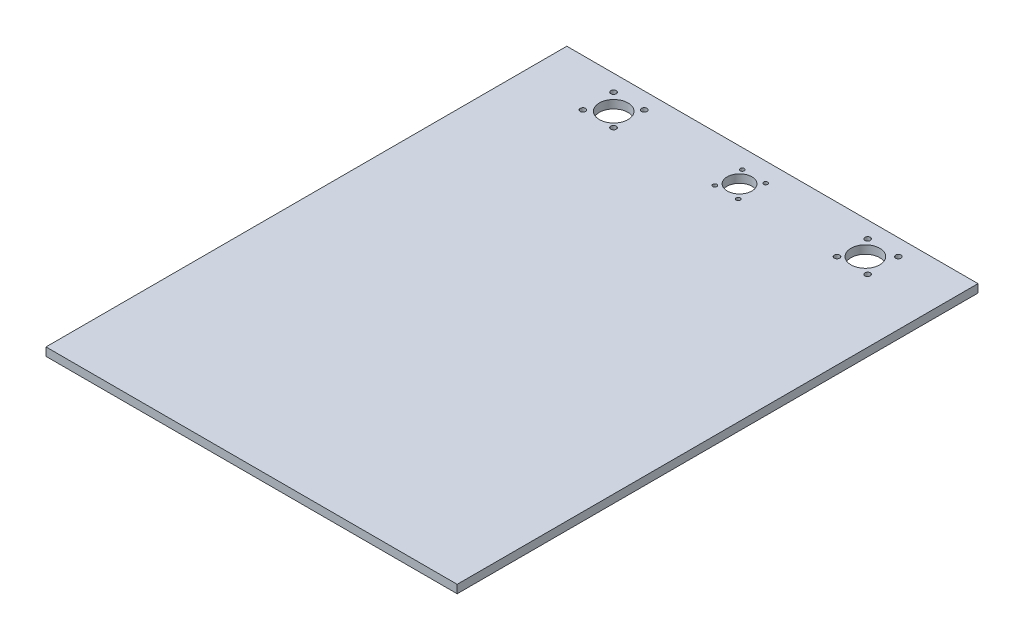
ISO-10303-21;
HEADER;
FILE_DESCRIPTION(('STEP AP214'),'2;1');
FILE_NAME('part.step','',(''),(''),'','','');
FILE_SCHEMA(('AUTOMOTIVE_DESIGN { 1 0 10303 214 1 1 1 1 }'));
ENDSEC;
DATA;
#1=APPLICATION_CONTEXT('core data for automotive mechanical design processes');
#2=APPLICATION_PROTOCOL_DEFINITION('international standard','automotive_design',2000,#1);
#3=PRODUCT_CONTEXT('',#1,'mechanical');
#4=PRODUCT('Part','Part','',(#3));
#5=PRODUCT_RELATED_PRODUCT_CATEGORY('part','',(#4));
#6=PRODUCT_DEFINITION_FORMATION('','',#4);
#7=PRODUCT_DEFINITION_CONTEXT('part definition',#1,'design');
#8=PRODUCT_DEFINITION('design','',#6,#7);
#9=PRODUCT_DEFINITION_SHAPE('','',#8);
#10=(LENGTH_UNIT() NAMED_UNIT(*) SI_UNIT(.MILLI.,.METRE.));
#11=(NAMED_UNIT(*) PLANE_ANGLE_UNIT() SI_UNIT($,.RADIAN.));
#12=(NAMED_UNIT(*) SI_UNIT($,.STERADIAN.) SOLID_ANGLE_UNIT());
#13=UNCERTAINTY_MEASURE_WITH_UNIT(LENGTH_MEASURE(1.E-05),#10,'distance_accuracy_value','');
#14=(GEOMETRIC_REPRESENTATION_CONTEXT(3) GLOBAL_UNCERTAINTY_ASSIGNED_CONTEXT((#13)) GLOBAL_UNIT_ASSIGNED_CONTEXT((#10,
#11,#12)) REPRESENTATION_CONTEXT('',''));
#15=CARTESIAN_POINT('',(0.,0.,0.));
#16=DIRECTION('',(0.,0.,1.));
#17=DIRECTION('',(1.,0.,0.));
#18=AXIS2_PLACEMENT_3D('',#15,#16,#17);
#19=CARTESIAN_POINT('',(0.,6.,0.));
#20=DIRECTION('',(0.,1.,0.));
#21=DIRECTION('',(0.,0.,1.));
#22=AXIS2_PLACEMENT_3D('',#19,#20,#21);
#23=PLANE('',#22);
#24=CARTESIAN_POINT('',(9.1,6.,-156.));
#25=DIRECTION('',(0.,1.,0.));
#26=DIRECTION('',(0.,0.,1.));
#27=AXIS2_PLACEMENT_3D('',#24,#25,#26);
#28=CIRCLE('',#27,1.5);
#29=CARTESIAN_POINT('',(9.1,6.,-154.5));
#30=VERTEX_POINT('',#29);
#31=EDGE_CURVE('E195',#30,#30,#28,.T.);
#32=ORIENTED_EDGE('',*,*,#31,.F.);
#33=EDGE_LOOP('',(#32));
#34=FACE_BOUND('',#33,.T.);
#35=CARTESIAN_POINT('',(-8.00000000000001,6.,-176.));
#36=DIRECTION('',(0.,1.,0.));
#37=DIRECTION('',(0.,0.,1.));
#38=AXIS2_PLACEMENT_3D('',#35,#36,#37);
#39=CIRCLE('',#38,1.5);
#40=CARTESIAN_POINT('',(-8.00000000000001,6.,-174.5));
#41=VERTEX_POINT('',#40);
#42=EDGE_CURVE('E183',#41,#41,#39,.T.);
#43=ORIENTED_EDGE('',*,*,#42,.F.);
#44=EDGE_LOOP('',(#43));
#45=FACE_BOUND('',#44,.T.);
#46=CARTESIAN_POINT('',(81.4999999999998,6.,-155.6));
#47=DIRECTION('',(0.,1.,0.));
#48=DIRECTION('',(0.,0.,-1.));
#49=AXIS2_PLACEMENT_3D('',#46,#47,#48);
#50=CIRCLE('',#49,2.);
#51=CARTESIAN_POINT('',(81.4999999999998,6.,-157.6));
#52=VERTEX_POINT('',#51);
#53=EDGE_CURVE('E171',#52,#52,#50,.T.);
#54=ORIENTED_EDGE('',*,*,#53,.F.);
#55=EDGE_LOOP('',(#54));
#56=FACE_BOUND('',#55,.T.);
#57=CARTESIAN_POINT('',(103.9,6.,-178.));
#58=DIRECTION('',(0.,1.,0.));
#59=DIRECTION('',(0.,0.,-1.));
#60=AXIS2_PLACEMENT_3D('',#57,#58,#59);
#61=CIRCLE('',#60,2.);
#62=CARTESIAN_POINT('',(103.9,6.,-180.));
#63=VERTEX_POINT('',#62);
#64=EDGE_CURVE('E159',#63,#63,#61,.T.);
#65=ORIENTED_EDGE('',*,*,#64,.F.);
#66=EDGE_LOOP('',(#65));
#67=FACE_BOUND('',#66,.T.);
#68=CARTESIAN_POINT('',(-103.9,6.,-155.6));
#69=DIRECTION('',(0.,1.,0.));
#70=DIRECTION('',(0.,0.,1.));
#71=AXIS2_PLACEMENT_3D('',#68,#69,#70);
#72=CIRCLE('',#71,2.);
#73=CARTESIAN_POINT('',(-103.9,6.,-153.6));
#74=VERTEX_POINT('',#73);
#75=EDGE_CURVE('E147',#74,#74,#72,.T.);
#76=ORIENTED_EDGE('',*,*,#75,.F.);
#77=EDGE_LOOP('',(#76));
#78=FACE_BOUND('',#77,.T.);
#79=CARTESIAN_POINT('',(-81.5,6.,-178.));
#80=DIRECTION('',(0.,1.,0.));
#81=DIRECTION('',(0.,0.,1.));
#82=AXIS2_PLACEMENT_3D('',#79,#80,#81);
#83=CIRCLE('',#82,2.);
#84=CARTESIAN_POINT('',(-81.5,6.,-176.));
#85=VERTEX_POINT('',#84);
#86=EDGE_CURVE('E135',#85,#85,#83,.T.);
#87=ORIENTED_EDGE('',*,*,#86,.F.);
#88=EDGE_LOOP('',(#87));
#89=FACE_BOUND('',#88,.T.);
#90=CARTESIAN_POINT('',(-91.8,6.,-166.));
#91=DIRECTION('',(0.,1.,0.));
#92=DIRECTION('',(0.,0.,1.));
#93=AXIS2_PLACEMENT_3D('',#90,#91,#92);
#94=CIRCLE('',#93,10.5);
#95=CARTESIAN_POINT('',(-91.8,6.,-155.5));
#96=VERTEX_POINT('',#95);
#97=EDGE_CURVE('E123',#96,#96,#94,.T.);
#98=ORIENTED_EDGE('',*,*,#97,.F.);
#99=EDGE_LOOP('',(#98));
#100=FACE_BOUND('',#99,.T.);
#101=DIRECTION('',(0.,0.,-1.));
#102=VECTOR('',#101,1.);
#103=CARTESIAN_POINT('',(150.,6.,-190.));
#104=LINE('',#103,#102);
#105=CARTESIAN_POINT('',(150.,6.,190.));
#106=VERTEX_POINT('',#105);
#107=CARTESIAN_POINT('',(150.,6.,-190.));
#108=VERTEX_POINT('',#107);
#109=EDGE_CURVE('E93',#106,#108,#104,.T.);
#110=ORIENTED_EDGE('',*,*,#109,.T.);
#111=DIRECTION('',(-1.,0.,0.));
#112=VECTOR('',#111,1.);
#113=CARTESIAN_POINT('',(-150.,6.,-190.));
#114=LINE('',#113,#112);
#115=CARTESIAN_POINT('',(-150.,6.,-190.));
#116=VERTEX_POINT('',#115);
#117=EDGE_CURVE('E88',#108,#116,#114,.T.);
#118=ORIENTED_EDGE('',*,*,#117,.T.);
#119=DIRECTION('',(0.,0.,1.));
#120=VECTOR('',#119,1.);
#121=CARTESIAN_POINT('',(-150.,6.,-190.));
#122=LINE('',#121,#120);
#123=CARTESIAN_POINT('',(-150.,6.,190.));
#124=VERTEX_POINT('',#123);
#125=EDGE_CURVE('E91',#116,#124,#122,.T.);
#126=ORIENTED_EDGE('',*,*,#125,.T.);
#127=DIRECTION('',(1.,0.,0.));
#128=VECTOR('',#127,1.);
#129=CARTESIAN_POINT('',(-150.,6.,190.));
#130=LINE('',#129,#128);
#131=EDGE_CURVE('E58',#124,#106,#130,.T.);
#132=ORIENTED_EDGE('',*,*,#131,.T.);
#133=EDGE_LOOP('',(#110,#118,#126,#132));
#134=FACE_BOUND('',#133,.T.);
#135=CARTESIAN_POINT('',(0.,6.,-166.));
#136=DIRECTION('',(0.,1.,0.));
#137=DIRECTION('',(0.,0.,1.));
#138=AXIS2_PLACEMENT_3D('',#135,#136,#137);
#139=CIRCLE('',#138,9.00000000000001);
#140=CARTESIAN_POINT('',(0.,6.,-157.));
#141=VERTEX_POINT('',#140);
#142=EDGE_CURVE('E108',#141,#141,#139,.T.);
#143=ORIENTED_EDGE('',*,*,#142,.F.);
#144=EDGE_LOOP('',(#143));
#145=FACE_BOUND('',#144,.T.);
#146=CARTESIAN_POINT('',(91.8,6.,-166.));
#147=DIRECTION('',(0.,1.,0.));
#148=DIRECTION('',(0.,0.,1.));
#149=AXIS2_PLACEMENT_3D('',#146,#147,#148);
#150=CIRCLE('',#149,10.5);
#151=CARTESIAN_POINT('',(91.8,6.,-155.5));
#152=VERTEX_POINT('',#151);
#153=EDGE_CURVE('E129',#152,#152,#150,.T.);
#154=ORIENTED_EDGE('',*,*,#153,.F.);
#155=EDGE_LOOP('',(#154));
#156=FACE_BOUND('',#155,.T.);
#157=CARTESIAN_POINT('',(-103.9,6.,-178.));
#158=DIRECTION('',(0.,1.,0.));
#159=DIRECTION('',(0.,0.,1.));
#160=AXIS2_PLACEMENT_3D('',#157,#158,#159);
#161=CIRCLE('',#160,2.);
#162=CARTESIAN_POINT('',(-103.9,6.,-176.));
#163=VERTEX_POINT('',#162);
#164=EDGE_CURVE('E141',#163,#163,#161,.T.);
#165=ORIENTED_EDGE('',*,*,#164,.F.);
#166=EDGE_LOOP('',(#165));
#167=FACE_BOUND('',#166,.T.);
#168=CARTESIAN_POINT('',(-81.5,6.,-155.6));
#169=DIRECTION('',(0.,1.,0.));
#170=DIRECTION('',(0.,0.,1.));
#171=AXIS2_PLACEMENT_3D('',#168,#169,#170);
#172=CIRCLE('',#171,2.);
#173=CARTESIAN_POINT('',(-81.5,6.,-153.6));
#174=VERTEX_POINT('',#173);
#175=EDGE_CURVE('E153',#174,#174,#172,.T.);
#176=ORIENTED_EDGE('',*,*,#175,.F.);
#177=EDGE_LOOP('',(#176));
#178=FACE_BOUND('',#177,.T.);
#179=CARTESIAN_POINT('',(103.9,6.,-155.6));
#180=DIRECTION('',(0.,1.,0.));
#181=DIRECTION('',(0.,0.,-1.));
#182=AXIS2_PLACEMENT_3D('',#179,#180,#181);
#183=CIRCLE('',#182,2.);
#184=CARTESIAN_POINT('',(103.9,6.,-157.6));
#185=VERTEX_POINT('',#184);
#186=EDGE_CURVE('E165',#185,#185,#183,.T.);
#187=ORIENTED_EDGE('',*,*,#186,.F.);
#188=EDGE_LOOP('',(#187));
#189=FACE_BOUND('',#188,.T.);
#190=CARTESIAN_POINT('',(81.4999999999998,6.,-178.));
#191=DIRECTION('',(0.,1.,0.));
#192=DIRECTION('',(0.,0.,-1.));
#193=AXIS2_PLACEMENT_3D('',#190,#191,#192);
#194=CIRCLE('',#193,2.);
#195=CARTESIAN_POINT('',(81.4999999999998,6.,-180.));
#196=VERTEX_POINT('',#195);
#197=EDGE_CURVE('E177',#196,#196,#194,.T.);
#198=ORIENTED_EDGE('',*,*,#197,.F.);
#199=EDGE_LOOP('',(#198));
#200=FACE_BOUND('',#199,.T.);
#201=CARTESIAN_POINT('',(9.09999999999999,6.,-176.));
#202=DIRECTION('',(0.,1.,0.));
#203=DIRECTION('',(0.,0.,1.));
#204=AXIS2_PLACEMENT_3D('',#201,#202,#203);
#205=CIRCLE('',#204,1.5);
#206=CARTESIAN_POINT('',(9.09999999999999,6.,-174.5));
#207=VERTEX_POINT('',#206);
#208=EDGE_CURVE('E189',#207,#207,#205,.T.);
#209=ORIENTED_EDGE('',*,*,#208,.F.);
#210=EDGE_LOOP('',(#209));
#211=FACE_BOUND('',#210,.T.);
#212=CARTESIAN_POINT('',(-8.,6.,-156.));
#213=DIRECTION('',(0.,1.,0.));
#214=DIRECTION('',(0.,0.,1.));
#215=AXIS2_PLACEMENT_3D('',#212,#213,#214);
#216=CIRCLE('',#215,1.5);
#217=CARTESIAN_POINT('',(-8.,6.,-154.5));
#218=VERTEX_POINT('',#217);
#219=EDGE_CURVE('E201',#218,#218,#216,.T.);
#220=ORIENTED_EDGE('',*,*,#219,.F.);
#221=EDGE_LOOP('',(#220));
#222=FACE_BOUND('',#221,.T.);
#223=ADVANCED_FACE('F41',(#34,#45,#56,#67,#78,#89,#100,#134,#145,#156,#167,#178,#189,#200,#211,
#222),#23,.T.);
#224=CARTESIAN_POINT('',(0.,0.,0.));
#225=DIRECTION('',(0.,1.,0.));
#226=DIRECTION('',(0.,0.,1.));
#227=AXIS2_PLACEMENT_3D('',#224,#225,#226);
#228=PLANE('',#227);
#229=DIRECTION('',(0.,0.,-1.));
#230=VECTOR('',#229,1.);
#231=CARTESIAN_POINT('',(150.,0.,-190.));
#232=LINE('',#231,#230);
#233=CARTESIAN_POINT('',(150.,0.,190.));
#234=VERTEX_POINT('',#233);
#235=CARTESIAN_POINT('',(150.,0.,-190.));
#236=VERTEX_POINT('',#235);
#237=EDGE_CURVE('E105',#234,#236,#232,.T.);
#238=ORIENTED_EDGE('',*,*,#237,.F.);
#239=DIRECTION('',(1.,0.,0.));
#240=VECTOR('',#239,1.);
#241=CARTESIAN_POINT('',(-150.,0.,190.));
#242=LINE('',#241,#240);
#243=CARTESIAN_POINT('',(-150.,0.,190.));
#244=VERTEX_POINT('',#243);
#245=EDGE_CURVE('E81',#244,#234,#242,.T.);
#246=ORIENTED_EDGE('',*,*,#245,.F.);
#247=DIRECTION('',(0.,0.,1.));
#248=VECTOR('',#247,1.);
#249=CARTESIAN_POINT('',(-150.,0.,-190.));
#250=LINE('',#249,#248);
#251=CARTESIAN_POINT('',(-150.,0.,-190.));
#252=VERTEX_POINT('',#251);
#253=EDGE_CURVE('E75',#252,#244,#250,.T.);
#254=ORIENTED_EDGE('',*,*,#253,.F.);
#255=DIRECTION('',(-1.,0.,0.));
#256=VECTOR('',#255,1.);
#257=CARTESIAN_POINT('',(-150.,0.,-190.));
#258=LINE('',#257,#256);
#259=EDGE_CURVE('E97',#236,#252,#258,.T.);
#260=ORIENTED_EDGE('',*,*,#259,.F.);
#261=EDGE_LOOP('',(#238,#246,#254,#260));
#262=FACE_BOUND('',#261,.T.);
#263=CARTESIAN_POINT('',(0.,0.,-166.));
#264=DIRECTION('',(0.,1.,0.));
#265=DIRECTION('',(0.,0.,1.));
#266=AXIS2_PLACEMENT_3D('',#263,#264,#265);
#267=CIRCLE('',#266,9.00000000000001);
#268=CARTESIAN_POINT('',(0.,0.,-157.));
#269=VERTEX_POINT('',#268);
#270=EDGE_CURVE('E120',#269,#269,#267,.T.);
#271=ORIENTED_EDGE('',*,*,#270,.T.);
#272=EDGE_LOOP('',(#271));
#273=FACE_BOUND('',#272,.T.);
#274=CARTESIAN_POINT('',(-91.8,0.,-166.));
#275=DIRECTION('',(0.,1.,0.));
#276=DIRECTION('',(0.,0.,1.));
#277=AXIS2_PLACEMENT_3D('',#274,#275,#276);
#278=CIRCLE('',#277,10.5);
#279=CARTESIAN_POINT('',(-91.8,0.,-155.5));
#280=VERTEX_POINT('',#279);
#281=EDGE_CURVE('E126',#280,#280,#278,.T.);
#282=ORIENTED_EDGE('',*,*,#281,.T.);
#283=EDGE_LOOP('',(#282));
#284=FACE_BOUND('',#283,.T.);
#285=CARTESIAN_POINT('',(91.8,0.,-166.));
#286=DIRECTION('',(0.,1.,0.));
#287=DIRECTION('',(0.,0.,1.));
#288=AXIS2_PLACEMENT_3D('',#285,#286,#287);
#289=CIRCLE('',#288,10.5);
#290=CARTESIAN_POINT('',(91.8,0.,-155.5));
#291=VERTEX_POINT('',#290);
#292=EDGE_CURVE('E132',#291,#291,#289,.T.);
#293=ORIENTED_EDGE('',*,*,#292,.T.);
#294=EDGE_LOOP('',(#293));
#295=FACE_BOUND('',#294,.T.);
#296=CARTESIAN_POINT('',(-81.5,0.,-178.));
#297=DIRECTION('',(0.,1.,0.));
#298=DIRECTION('',(0.,0.,1.));
#299=AXIS2_PLACEMENT_3D('',#296,#297,#298);
#300=CIRCLE('',#299,2.);
#301=CARTESIAN_POINT('',(-81.5,0.,-176.));
#302=VERTEX_POINT('',#301);
#303=EDGE_CURVE('E138',#302,#302,#300,.T.);
#304=ORIENTED_EDGE('',*,*,#303,.T.);
#305=EDGE_LOOP('',(#304));
#306=FACE_BOUND('',#305,.T.);
#307=CARTESIAN_POINT('',(-103.9,0.,-178.));
#308=DIRECTION('',(0.,1.,0.));
#309=DIRECTION('',(0.,0.,1.));
#310=AXIS2_PLACEMENT_3D('',#307,#308,#309);
#311=CIRCLE('',#310,2.);
#312=CARTESIAN_POINT('',(-103.9,0.,-176.));
#313=VERTEX_POINT('',#312);
#314=EDGE_CURVE('E144',#313,#313,#311,.T.);
#315=ORIENTED_EDGE('',*,*,#314,.T.);
#316=EDGE_LOOP('',(#315));
#317=FACE_BOUND('',#316,.T.);
#318=CARTESIAN_POINT('',(-103.9,0.,-155.6));
#319=DIRECTION('',(0.,1.,0.));
#320=DIRECTION('',(0.,0.,1.));
#321=AXIS2_PLACEMENT_3D('',#318,#319,#320);
#322=CIRCLE('',#321,2.);
#323=CARTESIAN_POINT('',(-103.9,0.,-153.6));
#324=VERTEX_POINT('',#323);
#325=EDGE_CURVE('E150',#324,#324,#322,.T.);
#326=ORIENTED_EDGE('',*,*,#325,.T.);
#327=EDGE_LOOP('',(#326));
#328=FACE_BOUND('',#327,.T.);
#329=CARTESIAN_POINT('',(-81.5,0.,-155.6));
#330=DIRECTION('',(0.,1.,0.));
#331=DIRECTION('',(0.,0.,1.));
#332=AXIS2_PLACEMENT_3D('',#329,#330,#331);
#333=CIRCLE('',#332,2.);
#334=CARTESIAN_POINT('',(-81.5,0.,-153.6));
#335=VERTEX_POINT('',#334);
#336=EDGE_CURVE('E156',#335,#335,#333,.T.);
#337=ORIENTED_EDGE('',*,*,#336,.T.);
#338=EDGE_LOOP('',(#337));
#339=FACE_BOUND('',#338,.T.);
#340=CARTESIAN_POINT('',(103.9,0.,-178.));
#341=DIRECTION('',(0.,1.,0.));
#342=DIRECTION('',(0.,0.,-1.));
#343=AXIS2_PLACEMENT_3D('',#340,#341,#342);
#344=CIRCLE('',#343,2.);
#345=CARTESIAN_POINT('',(103.9,0.,-180.));
#346=VERTEX_POINT('',#345);
#347=EDGE_CURVE('E162',#346,#346,#344,.T.);
#348=ORIENTED_EDGE('',*,*,#347,.T.);
#349=EDGE_LOOP('',(#348));
#350=FACE_BOUND('',#349,.T.);
#351=CARTESIAN_POINT('',(103.9,0.,-155.6));
#352=DIRECTION('',(0.,1.,0.));
#353=DIRECTION('',(0.,0.,-1.));
#354=AXIS2_PLACEMENT_3D('',#351,#352,#353);
#355=CIRCLE('',#354,2.);
#356=CARTESIAN_POINT('',(103.9,0.,-157.6));
#357=VERTEX_POINT('',#356);
#358=EDGE_CURVE('E168',#357,#357,#355,.T.);
#359=ORIENTED_EDGE('',*,*,#358,.T.);
#360=EDGE_LOOP('',(#359));
#361=FACE_BOUND('',#360,.T.);
#362=CARTESIAN_POINT('',(81.4999999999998,0.,-155.6));
#363=DIRECTION('',(0.,1.,0.));
#364=DIRECTION('',(0.,0.,-1.));
#365=AXIS2_PLACEMENT_3D('',#362,#363,#364);
#366=CIRCLE('',#365,2.);
#367=CARTESIAN_POINT('',(81.4999999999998,0.,-157.6));
#368=VERTEX_POINT('',#367);
#369=EDGE_CURVE('E174',#368,#368,#366,.T.);
#370=ORIENTED_EDGE('',*,*,#369,.T.);
#371=EDGE_LOOP('',(#370));
#372=FACE_BOUND('',#371,.T.);
#373=CARTESIAN_POINT('',(81.4999999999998,0.,-178.));
#374=DIRECTION('',(0.,1.,0.));
#375=DIRECTION('',(0.,0.,-1.));
#376=AXIS2_PLACEMENT_3D('',#373,#374,#375);
#377=CIRCLE('',#376,2.);
#378=CARTESIAN_POINT('',(81.4999999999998,0.,-180.));
#379=VERTEX_POINT('',#378);
#380=EDGE_CURVE('E180',#379,#379,#377,.T.);
#381=ORIENTED_EDGE('',*,*,#380,.T.);
#382=EDGE_LOOP('',(#381));
#383=FACE_BOUND('',#382,.T.);
#384=CARTESIAN_POINT('',(-8.00000000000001,0.,-176.));
#385=DIRECTION('',(0.,1.,0.));
#386=DIRECTION('',(0.,0.,1.));
#387=AXIS2_PLACEMENT_3D('',#384,#385,#386);
#388=CIRCLE('',#387,1.5);
#389=CARTESIAN_POINT('',(-8.00000000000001,0.,-174.5));
#390=VERTEX_POINT('',#389);
#391=EDGE_CURVE('E186',#390,#390,#388,.T.);
#392=ORIENTED_EDGE('',*,*,#391,.T.);
#393=EDGE_LOOP('',(#392));
#394=FACE_BOUND('',#393,.T.);
#395=CARTESIAN_POINT('',(9.09999999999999,0.,-176.));
#396=DIRECTION('',(0.,1.,0.));
#397=DIRECTION('',(0.,0.,1.));
#398=AXIS2_PLACEMENT_3D('',#395,#396,#397);
#399=CIRCLE('',#398,1.5);
#400=CARTESIAN_POINT('',(9.09999999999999,0.,-174.5));
#401=VERTEX_POINT('',#400);
#402=EDGE_CURVE('E192',#401,#401,#399,.T.);
#403=ORIENTED_EDGE('',*,*,#402,.T.);
#404=EDGE_LOOP('',(#403));
#405=FACE_BOUND('',#404,.T.);
#406=CARTESIAN_POINT('',(9.1,0.,-156.));
#407=DIRECTION('',(0.,1.,0.));
#408=DIRECTION('',(0.,0.,1.));
#409=AXIS2_PLACEMENT_3D('',#406,#407,#408);
#410=CIRCLE('',#409,1.5);
#411=CARTESIAN_POINT('',(9.1,0.,-154.5));
#412=VERTEX_POINT('',#411);
#413=EDGE_CURVE('E198',#412,#412,#410,.T.);
#414=ORIENTED_EDGE('',*,*,#413,.T.);
#415=EDGE_LOOP('',(#414));
#416=FACE_BOUND('',#415,.T.);
#417=CARTESIAN_POINT('',(-8.,0.,-156.));
#418=DIRECTION('',(0.,1.,0.));
#419=DIRECTION('',(0.,0.,1.));
#420=AXIS2_PLACEMENT_3D('',#417,#418,#419);
#421=CIRCLE('',#420,1.5);
#422=CARTESIAN_POINT('',(-8.,0.,-154.5));
#423=VERTEX_POINT('',#422);
#424=EDGE_CURVE('E204',#423,#423,#421,.T.);
#425=ORIENTED_EDGE('',*,*,#424,.T.);
#426=EDGE_LOOP('',(#425));
#427=FACE_BOUND('',#426,.T.);
#428=ADVANCED_FACE('F116',(#262,#273,#284,#295,#306,#317,#328,#339,#350,#361,#372,#383,#394,
#405,#416,#427),#228,.F.);
#429=CARTESIAN_POINT('',(150.,6.,-190.));
#430=DIRECTION('',(-1.,0.,0.));
#431=DIRECTION('',(0.,0.,1.));
#432=AXIS2_PLACEMENT_3D('',#429,#430,#431);
#433=PLANE('',#432);
#434=ORIENTED_EDGE('',*,*,#237,.T.);
#435=DIRECTION('',(0.,-1.,0.));
#436=VECTOR('',#435,1.);
#437=CARTESIAN_POINT('',(150.,6.,-190.));
#438=LINE('',#437,#436);
#439=EDGE_CURVE('E11',#108,#236,#438,.T.);
#440=ORIENTED_EDGE('',*,*,#439,.F.);
#441=ORIENTED_EDGE('',*,*,#109,.F.);
#442=DIRECTION('',(0.,-1.,0.));
#443=VECTOR('',#442,1.);
#444=CARTESIAN_POINT('',(150.,6.,190.));
#445=LINE('',#444,#443);
#446=EDGE_CURVE('E101',#106,#234,#445,.T.);
#447=ORIENTED_EDGE('',*,*,#446,.T.);
#448=EDGE_LOOP('',(#434,#440,#441,#447));
#449=FACE_BOUND('',#448,.T.);
#450=ADVANCED_FACE('F43',(#449),#433,.F.);
#451=CARTESIAN_POINT('',(-150.,6.,-190.));
#452=DIRECTION('',(0.,0.,1.));
#453=DIRECTION('',(1.,0.,0.));
#454=AXIS2_PLACEMENT_3D('',#451,#452,#453);
#455=PLANE('',#454);
#456=ORIENTED_EDGE('',*,*,#259,.T.);
#457=DIRECTION('',(0.,-1.,0.));
#458=VECTOR('',#457,1.);
#459=CARTESIAN_POINT('',(-150.,6.,-190.));
#460=LINE('',#459,#458);
#461=EDGE_CURVE('E50',#116,#252,#460,.T.);
#462=ORIENTED_EDGE('',*,*,#461,.F.);
#463=ORIENTED_EDGE('',*,*,#117,.F.);
#464=ORIENTED_EDGE('',*,*,#439,.T.);
#465=EDGE_LOOP('',(#456,#462,#463,#464));
#466=FACE_BOUND('',#465,.T.);
#467=ADVANCED_FACE('F96',(#466),#455,.F.);
#468=CARTESIAN_POINT('',(-150.,6.,-190.));
#469=DIRECTION('',(1.,0.,0.));
#470=DIRECTION('',(0.,0.,-1.));
#471=AXIS2_PLACEMENT_3D('',#468,#469,#470);
#472=PLANE('',#471);
#473=ORIENTED_EDGE('',*,*,#253,.T.);
#474=DIRECTION('',(0.,-1.,0.));
#475=VECTOR('',#474,1.);
#476=CARTESIAN_POINT('',(-150.,6.,190.));
#477=LINE('',#476,#475);
#478=EDGE_CURVE('E98',#124,#244,#477,.T.);
#479=ORIENTED_EDGE('',*,*,#478,.F.);
#480=ORIENTED_EDGE('',*,*,#125,.F.);
#481=ORIENTED_EDGE('',*,*,#461,.T.);
#482=EDGE_LOOP('',(#473,#479,#480,#481));
#483=FACE_BOUND('',#482,.T.);
#484=ADVANCED_FACE('F99',(#483),#472,.F.);
#485=CARTESIAN_POINT('',(-150.,6.,190.));
#486=DIRECTION('',(0.,0.,-1.));
#487=DIRECTION('',(-1.,0.,0.));
#488=AXIS2_PLACEMENT_3D('',#485,#486,#487);
#489=PLANE('',#488);
#490=ORIENTED_EDGE('',*,*,#245,.T.);
#491=ORIENTED_EDGE('',*,*,#446,.F.);
#492=ORIENTED_EDGE('',*,*,#131,.F.);
#493=ORIENTED_EDGE('',*,*,#478,.T.);
#494=EDGE_LOOP('',(#490,#491,#492,#493));
#495=FACE_BOUND('',#494,.T.);
#496=ADVANCED_FACE('F113',(#495),#489,.F.);
#497=CARTESIAN_POINT('',(0.,6.,-166.));
#498=DIRECTION('',(0.,-1.,0.));
#499=DIRECTION('',(0.,0.,-1.));
#500=AXIS2_PLACEMENT_3D('',#497,#498,#499);
#501=CYLINDRICAL_SURFACE('',#500,9.00000000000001);
#502=ORIENTED_EDGE('',*,*,#142,.T.);
#503=EDGE_LOOP('',(#502));
#504=FACE_BOUND('',#503,.T.);
#505=ORIENTED_EDGE('',*,*,#270,.F.);
#506=EDGE_LOOP('',(#505));
#507=FACE_BOUND('',#506,.T.);
#508=ADVANCED_FACE('F223',(#504,#507),#501,.F.);
#509=CARTESIAN_POINT('',(-91.8,6.,-166.));
#510=DIRECTION('',(0.,-1.,0.));
#511=DIRECTION('',(0.,0.,-1.));
#512=AXIS2_PLACEMENT_3D('',#509,#510,#511);
#513=CYLINDRICAL_SURFACE('',#512,10.5);
#514=ORIENTED_EDGE('',*,*,#97,.T.);
#515=EDGE_LOOP('',(#514));
#516=FACE_BOUND('',#515,.T.);
#517=ORIENTED_EDGE('',*,*,#281,.F.);
#518=EDGE_LOOP('',(#517));
#519=FACE_BOUND('',#518,.T.);
#520=ADVANCED_FACE('F275',(#516,#519),#513,.F.);
#521=CARTESIAN_POINT('',(91.8,6.,-166.));
#522=DIRECTION('',(0.,-1.,0.));
#523=DIRECTION('',(0.,0.,-1.));
#524=AXIS2_PLACEMENT_3D('',#521,#522,#523);
#525=CYLINDRICAL_SURFACE('',#524,10.5);
#526=ORIENTED_EDGE('',*,*,#153,.T.);
#527=EDGE_LOOP('',(#526));
#528=FACE_BOUND('',#527,.T.);
#529=ORIENTED_EDGE('',*,*,#292,.F.);
#530=EDGE_LOOP('',(#529));
#531=FACE_BOUND('',#530,.T.);
#532=ADVANCED_FACE('F284',(#528,#531),#525,.F.);
#533=CARTESIAN_POINT('',(-81.5,6.,-178.));
#534=DIRECTION('',(0.,-1.,0.));
#535=DIRECTION('',(0.,0.,-1.));
#536=AXIS2_PLACEMENT_3D('',#533,#534,#535);
#537=CYLINDRICAL_SURFACE('',#536,2.);
#538=ORIENTED_EDGE('',*,*,#86,.T.);
#539=EDGE_LOOP('',(#538));
#540=FACE_BOUND('',#539,.T.);
#541=ORIENTED_EDGE('',*,*,#303,.F.);
#542=EDGE_LOOP('',(#541));
#543=FACE_BOUND('',#542,.T.);
#544=ADVANCED_FACE('F293',(#540,#543),#537,.F.);
#545=CARTESIAN_POINT('',(-103.9,6.,-178.));
#546=DIRECTION('',(0.,-1.,0.));
#547=DIRECTION('',(0.,0.,-1.));
#548=AXIS2_PLACEMENT_3D('',#545,#546,#547);
#549=CYLINDRICAL_SURFACE('',#548,2.);
#550=ORIENTED_EDGE('',*,*,#164,.T.);
#551=EDGE_LOOP('',(#550));
#552=FACE_BOUND('',#551,.T.);
#553=ORIENTED_EDGE('',*,*,#314,.F.);
#554=EDGE_LOOP('',(#553));
#555=FACE_BOUND('',#554,.T.);
#556=ADVANCED_FACE('F303',(#552,#555),#549,.F.);
#557=CARTESIAN_POINT('',(-103.9,6.,-155.6));
#558=DIRECTION('',(0.,-1.,0.));
#559=DIRECTION('',(0.,0.,-1.));
#560=AXIS2_PLACEMENT_3D('',#557,#558,#559);
#561=CYLINDRICAL_SURFACE('',#560,2.);
#562=ORIENTED_EDGE('',*,*,#75,.T.);
#563=EDGE_LOOP('',(#562));
#564=FACE_BOUND('',#563,.T.);
#565=ORIENTED_EDGE('',*,*,#325,.F.);
#566=EDGE_LOOP('',(#565));
#567=FACE_BOUND('',#566,.T.);
#568=ADVANCED_FACE('F313',(#564,#567),#561,.F.);
#569=CARTESIAN_POINT('',(-81.5,6.,-155.6));
#570=DIRECTION('',(0.,-1.,0.));
#571=DIRECTION('',(0.,0.,-1.));
#572=AXIS2_PLACEMENT_3D('',#569,#570,#571);
#573=CYLINDRICAL_SURFACE('',#572,2.);
#574=ORIENTED_EDGE('',*,*,#175,.T.);
#575=EDGE_LOOP('',(#574));
#576=FACE_BOUND('',#575,.T.);
#577=ORIENTED_EDGE('',*,*,#336,.F.);
#578=EDGE_LOOP('',(#577));
#579=FACE_BOUND('',#578,.T.);
#580=ADVANCED_FACE('F323',(#576,#579),#573,.F.);
#581=CARTESIAN_POINT('',(103.9,6.,-178.));
#582=DIRECTION('',(0.,-1.,0.));
#583=DIRECTION('',(0.,0.,-1.));
#584=AXIS2_PLACEMENT_3D('',#581,#582,#583);
#585=CYLINDRICAL_SURFACE('',#584,2.);
#586=ORIENTED_EDGE('',*,*,#64,.T.);
#587=EDGE_LOOP('',(#586));
#588=FACE_BOUND('',#587,.T.);
#589=ORIENTED_EDGE('',*,*,#347,.F.);
#590=EDGE_LOOP('',(#589));
#591=FACE_BOUND('',#590,.T.);
#592=ADVANCED_FACE('F333',(#588,#591),#585,.F.);
#593=CARTESIAN_POINT('',(103.9,6.,-155.6));
#594=DIRECTION('',(0.,-1.,0.));
#595=DIRECTION('',(0.,0.,-1.));
#596=AXIS2_PLACEMENT_3D('',#593,#594,#595);
#597=CYLINDRICAL_SURFACE('',#596,2.);
#598=ORIENTED_EDGE('',*,*,#186,.T.);
#599=EDGE_LOOP('',(#598));
#600=FACE_BOUND('',#599,.T.);
#601=ORIENTED_EDGE('',*,*,#358,.F.);
#602=EDGE_LOOP('',(#601));
#603=FACE_BOUND('',#602,.T.);
#604=ADVANCED_FACE('F343',(#600,#603),#597,.F.);
#605=CARTESIAN_POINT('',(81.4999999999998,6.,-155.6));
#606=DIRECTION('',(0.,-1.,0.));
#607=DIRECTION('',(0.,0.,-1.));
#608=AXIS2_PLACEMENT_3D('',#605,#606,#607);
#609=CYLINDRICAL_SURFACE('',#608,2.);
#610=ORIENTED_EDGE('',*,*,#53,.T.);
#611=EDGE_LOOP('',(#610));
#612=FACE_BOUND('',#611,.T.);
#613=ORIENTED_EDGE('',*,*,#369,.F.);
#614=EDGE_LOOP('',(#613));
#615=FACE_BOUND('',#614,.T.);
#616=ADVANCED_FACE('F353',(#612,#615),#609,.F.);
#617=CARTESIAN_POINT('',(81.4999999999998,6.,-178.));
#618=DIRECTION('',(0.,-1.,0.));
#619=DIRECTION('',(0.,0.,-1.));
#620=AXIS2_PLACEMENT_3D('',#617,#618,#619);
#621=CYLINDRICAL_SURFACE('',#620,2.);
#622=ORIENTED_EDGE('',*,*,#197,.T.);
#623=EDGE_LOOP('',(#622));
#624=FACE_BOUND('',#623,.T.);
#625=ORIENTED_EDGE('',*,*,#380,.F.);
#626=EDGE_LOOP('',(#625));
#627=FACE_BOUND('',#626,.T.);
#628=ADVANCED_FACE('F363',(#624,#627),#621,.F.);
#629=CARTESIAN_POINT('',(-8.00000000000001,6.,-176.));
#630=DIRECTION('',(0.,-1.,0.));
#631=DIRECTION('',(0.,0.,-1.));
#632=AXIS2_PLACEMENT_3D('',#629,#630,#631);
#633=CYLINDRICAL_SURFACE('',#632,1.5);
#634=ORIENTED_EDGE('',*,*,#42,.T.);
#635=EDGE_LOOP('',(#634));
#636=FACE_BOUND('',#635,.T.);
#637=ORIENTED_EDGE('',*,*,#391,.F.);
#638=EDGE_LOOP('',(#637));
#639=FACE_BOUND('',#638,.T.);
#640=ADVANCED_FACE('F373',(#636,#639),#633,.F.);
#641=CARTESIAN_POINT('',(9.09999999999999,6.,-176.));
#642=DIRECTION('',(0.,-1.,0.));
#643=DIRECTION('',(0.,0.,-1.));
#644=AXIS2_PLACEMENT_3D('',#641,#642,#643);
#645=CYLINDRICAL_SURFACE('',#644,1.5);
#646=ORIENTED_EDGE('',*,*,#208,.T.);
#647=EDGE_LOOP('',(#646));
#648=FACE_BOUND('',#647,.T.);
#649=ORIENTED_EDGE('',*,*,#402,.F.);
#650=EDGE_LOOP('',(#649));
#651=FACE_BOUND('',#650,.T.);
#652=ADVANCED_FACE('F383',(#648,#651),#645,.F.);
#653=CARTESIAN_POINT('',(9.1,6.,-156.));
#654=DIRECTION('',(0.,-1.,0.));
#655=DIRECTION('',(0.,0.,-1.));
#656=AXIS2_PLACEMENT_3D('',#653,#654,#655);
#657=CYLINDRICAL_SURFACE('',#656,1.5);
#658=ORIENTED_EDGE('',*,*,#31,.T.);
#659=EDGE_LOOP('',(#658));
#660=FACE_BOUND('',#659,.T.);
#661=ORIENTED_EDGE('',*,*,#413,.F.);
#662=EDGE_LOOP('',(#661));
#663=FACE_BOUND('',#662,.T.);
#664=ADVANCED_FACE('F393',(#660,#663),#657,.F.);
#665=CARTESIAN_POINT('',(-8.,6.,-156.));
#666=DIRECTION('',(0.,-1.,0.));
#667=DIRECTION('',(0.,0.,-1.));
#668=AXIS2_PLACEMENT_3D('',#665,#666,#667);
#669=CYLINDRICAL_SURFACE('',#668,1.5);
#670=ORIENTED_EDGE('',*,*,#219,.T.);
#671=EDGE_LOOP('',(#670));
#672=FACE_BOUND('',#671,.T.);
#673=ORIENTED_EDGE('',*,*,#424,.F.);
#674=EDGE_LOOP('',(#673));
#675=FACE_BOUND('',#674,.T.);
#676=ADVANCED_FACE('F210',(#672,#675),#669,.F.);
#677=CLOSED_SHELL('',(#223,#428,#450,#467,#484,#496,#508,#520,#532,#544,#556,#568,#580,#592,
#604,#616,#628,#640,#652,#664,#676));
#678=MANIFOLD_SOLID_BREP('B2',#677);
#679=ADVANCED_BREP_SHAPE_REPRESENTATION('',(#18,#678),#14);
#680=SHAPE_DEFINITION_REPRESENTATION(#9,#679);
ENDSEC;
END-ISO-10303-21;
